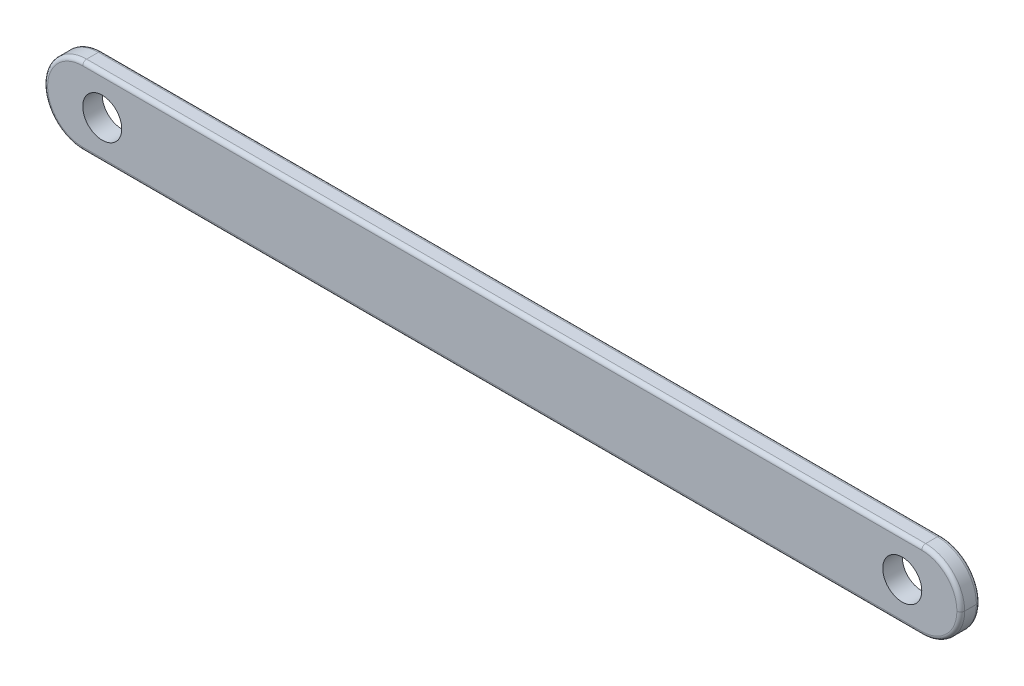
ISO-10303-21;
HEADER;
FILE_DESCRIPTION(('STEP AP214'),'2;1');
FILE_NAME('part.step','',(''),(''),'','','');
FILE_SCHEMA(('AUTOMOTIVE_DESIGN { 1 0 10303 214 1 1 1 1 }'));
ENDSEC;
DATA;
#1=APPLICATION_CONTEXT('core data for automotive mechanical design processes');
#2=APPLICATION_PROTOCOL_DEFINITION('international standard','automotive_design',2000,#1);
#3=PRODUCT_CONTEXT('',#1,'mechanical');
#4=PRODUCT('Part','Part','',(#3));
#5=PRODUCT_RELATED_PRODUCT_CATEGORY('part','',(#4));
#6=PRODUCT_DEFINITION_FORMATION('','',#4);
#7=PRODUCT_DEFINITION_CONTEXT('part definition',#1,'design');
#8=PRODUCT_DEFINITION('design','',#6,#7);
#9=PRODUCT_DEFINITION_SHAPE('','',#8);
#10=(LENGTH_UNIT() NAMED_UNIT(*) SI_UNIT(.MILLI.,.METRE.));
#11=(NAMED_UNIT(*) PLANE_ANGLE_UNIT() SI_UNIT($,.RADIAN.));
#12=(NAMED_UNIT(*) SI_UNIT($,.STERADIAN.) SOLID_ANGLE_UNIT());
#13=UNCERTAINTY_MEASURE_WITH_UNIT(LENGTH_MEASURE(1.E-05),#10,'distance_accuracy_value','');
#14=(GEOMETRIC_REPRESENTATION_CONTEXT(3) GLOBAL_UNCERTAINTY_ASSIGNED_CONTEXT((#13)) GLOBAL_UNIT_ASSIGNED_CONTEXT((#10,
#11,#12)) REPRESENTATION_CONTEXT('',''));
#15=CARTESIAN_POINT('',(0.,0.,0.));
#16=DIRECTION('',(0.,0.,1.));
#17=DIRECTION('',(1.,0.,0.));
#18=AXIS2_PLACEMENT_3D('',#15,#16,#17);
#19=CARTESIAN_POINT('',(0.,0.,5.));
#20=DIRECTION('',(0.,0.,1.));
#21=DIRECTION('',(1.,0.,0.));
#22=AXIS2_PLACEMENT_3D('',#19,#20,#21);
#23=PLANE('',#22);
#24=DIRECTION('',(1.,0.,0.));
#25=VECTOR('',#24,1.);
#26=CARTESIAN_POINT('',(-10.,0.999999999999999,5.));
#27=LINE('',#26,#25);
#28=CARTESIAN_POINT('',(-225.02,0.999999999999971,5.));
#29=VERTEX_POINT('',#28);
#30=CARTESIAN_POINT('',(-10.,0.999999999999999,5.));
#31=VERTEX_POINT('',#30);
#32=EDGE_CURVE('E63',#29,#31,#27,.T.);
#33=ORIENTED_EDGE('',*,*,#32,.T.);
#34=CARTESIAN_POINT('',(-10.,10.,5.));
#35=DIRECTION('',(0.,0.,1.));
#36=DIRECTION('',(1.,0.,0.));
#37=AXIS2_PLACEMENT_3D('',#34,#35,#36);
#38=CIRCLE('',#37,9.);
#39=CARTESIAN_POINT('',(-1.,10.,5.));
#40=VERTEX_POINT('',#39);
#41=EDGE_CURVE('E68',#31,#40,#38,.T.);
#42=ORIENTED_EDGE('',*,*,#41,.T.);
#43=CARTESIAN_POINT('',(-10.,10.,5.));
#44=DIRECTION('',(0.,0.,1.));
#45=DIRECTION('',(1.,0.,0.));
#46=AXIS2_PLACEMENT_3D('',#43,#44,#45);
#47=CIRCLE('',#46,9.);
#48=CARTESIAN_POINT('',(-10.,19.,5.));
#49=VERTEX_POINT('',#48);
#50=EDGE_CURVE('E226',#40,#49,#47,.T.);
#51=ORIENTED_EDGE('',*,*,#50,.T.);
#52=DIRECTION('',(-1.,0.,0.));
#53=VECTOR('',#52,1.);
#54=CARTESIAN_POINT('',(-225.02,19.,5.));
#55=LINE('',#54,#53);
#56=CARTESIAN_POINT('',(-225.02,19.,5.));
#57=VERTEX_POINT('',#56);
#58=EDGE_CURVE('E217',#49,#57,#55,.T.);
#59=ORIENTED_EDGE('',*,*,#58,.T.);
#60=CARTESIAN_POINT('',(-225.02,9.99999999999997,5.));
#61=DIRECTION('',(0.,0.,1.));
#62=DIRECTION('',(1.,0.,0.));
#63=AXIS2_PLACEMENT_3D('',#60,#61,#62);
#64=CIRCLE('',#63,9.);
#65=CARTESIAN_POINT('',(-234.02,9.99999999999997,5.));
#66=VERTEX_POINT('',#65);
#67=EDGE_CURVE('E220',#57,#66,#64,.T.);
#68=ORIENTED_EDGE('',*,*,#67,.T.);
#69=CARTESIAN_POINT('',(-225.02,9.99999999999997,5.));
#70=DIRECTION('',(0.,0.,1.));
#71=DIRECTION('',(1.,0.,0.));
#72=AXIS2_PLACEMENT_3D('',#69,#70,#71);
#73=CIRCLE('',#72,9.);
#74=EDGE_CURVE('E223',#66,#29,#73,.T.);
#75=ORIENTED_EDGE('',*,*,#74,.T.);
#76=EDGE_LOOP('',(#33,#42,#51,#59,#68,#75));
#77=FACE_BOUND('',#76,.T.);
#78=CARTESIAN_POINT('',(-220.02,10.,5.));
#79=DIRECTION('',(0.,0.,1.));
#80=DIRECTION('',(1.,0.,0.));
#81=AXIS2_PLACEMENT_3D('',#78,#79,#80);
#82=CIRCLE('',#81,4.99999999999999);
#83=CARTESIAN_POINT('',(-215.02,10.,5.));
#84=VERTEX_POINT('',#83);
#85=EDGE_CURVE('E310',#84,#84,#82,.T.);
#86=ORIENTED_EDGE('',*,*,#85,.F.);
#87=EDGE_LOOP('',(#86));
#88=FACE_BOUND('',#87,.T.);
#89=CARTESIAN_POINT('',(-15.,10.,5.));
#90=DIRECTION('',(0.,0.,1.));
#91=DIRECTION('',(1.,0.,0.));
#92=AXIS2_PLACEMENT_3D('',#89,#90,#91);
#93=CIRCLE('',#92,5.);
#94=CARTESIAN_POINT('',(-10.,10.,5.));
#95=VERTEX_POINT('',#94);
#96=EDGE_CURVE('E299',#95,#95,#93,.T.);
#97=ORIENTED_EDGE('',*,*,#96,.F.);
#98=EDGE_LOOP('',(#97));
#99=FACE_BOUND('',#98,.T.);
#100=ADVANCED_FACE('F45',(#77,#88,#99),#23,.T.);
#101=CARTESIAN_POINT('',(0.,0.,0.));
#102=DIRECTION('',(0.,0.,1.));
#103=DIRECTION('',(1.,0.,0.));
#104=AXIS2_PLACEMENT_3D('',#101,#102,#103);
#105=PLANE('',#104);
#106=DIRECTION('',(-1.,0.,0.));
#107=VECTOR('',#106,1.);
#108=CARTESIAN_POINT('',(0.,19.,0.));
#109=LINE('',#108,#107);
#110=CARTESIAN_POINT('',(-225.02,19.,0.));
#111=VERTEX_POINT('',#110);
#112=CARTESIAN_POINT('',(-10.,19.,0.));
#113=VERTEX_POINT('',#112);
#114=EDGE_CURVE('E141',#111,#113,#109,.F.);
#115=ORIENTED_EDGE('',*,*,#114,.T.);
#116=CARTESIAN_POINT('',(-10.,10.,0.));
#117=DIRECTION('',(0.,0.,1.));
#118=DIRECTION('',(1.,0.,0.));
#119=AXIS2_PLACEMENT_3D('',#116,#117,#118);
#120=CIRCLE('',#119,9.);
#121=CARTESIAN_POINT('',(-1.,10.,0.));
#122=VERTEX_POINT('',#121);
#123=EDGE_CURVE('E183',#113,#122,#120,.F.);
#124=ORIENTED_EDGE('',*,*,#123,.T.);
#125=CARTESIAN_POINT('',(-10.,10.,0.));
#126=DIRECTION('',(0.,0.,1.));
#127=DIRECTION('',(1.,0.,0.));
#128=AXIS2_PLACEMENT_3D('',#125,#126,#127);
#129=CIRCLE('',#128,9.);
#130=CARTESIAN_POINT('',(-10.,0.999999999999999,0.));
#131=VERTEX_POINT('',#130);
#132=EDGE_CURVE('E180',#122,#131,#129,.F.);
#133=ORIENTED_EDGE('',*,*,#132,.T.);
#134=DIRECTION('',(1.,0.,0.));
#135=VECTOR('',#134,1.);
#136=CARTESIAN_POINT('',(0.,1.,0.));
#137=LINE('',#136,#135);
#138=CARTESIAN_POINT('',(-225.02,0.999999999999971,0.));
#139=VERTEX_POINT('',#138);
#140=EDGE_CURVE('E177',#131,#139,#137,.F.);
#141=ORIENTED_EDGE('',*,*,#140,.T.);
#142=CARTESIAN_POINT('',(-225.02,9.99999999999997,0.));
#143=DIRECTION('',(0.,0.,1.));
#144=DIRECTION('',(1.,0.,0.));
#145=AXIS2_PLACEMENT_3D('',#142,#143,#144);
#146=CIRCLE('',#145,9.);
#147=CARTESIAN_POINT('',(-234.02,9.99999999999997,0.));
#148=VERTEX_POINT('',#147);
#149=EDGE_CURVE('E144',#139,#148,#146,.F.);
#150=ORIENTED_EDGE('',*,*,#149,.T.);
#151=CARTESIAN_POINT('',(-225.02,9.99999999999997,0.));
#152=DIRECTION('',(0.,0.,1.));
#153=DIRECTION('',(1.,0.,0.));
#154=AXIS2_PLACEMENT_3D('',#151,#152,#153);
#155=CIRCLE('',#154,9.);
#156=EDGE_CURVE('E135',#148,#111,#155,.F.);
#157=ORIENTED_EDGE('',*,*,#156,.T.);
#158=EDGE_LOOP('',(#115,#124,#133,#141,#150,#157));
#159=FACE_BOUND('',#158,.T.);
#160=CARTESIAN_POINT('',(-220.02,10.,0.));
#161=DIRECTION('',(0.,0.,1.));
#162=DIRECTION('',(1.,0.,0.));
#163=AXIS2_PLACEMENT_3D('',#160,#161,#162);
#164=CIRCLE('',#163,4.99999999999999);
#165=CARTESIAN_POINT('',(-215.02,10.,0.));
#166=VERTEX_POINT('',#165);
#167=EDGE_CURVE('E311',#166,#166,#164,.T.);
#168=ORIENTED_EDGE('',*,*,#167,.T.);
#169=EDGE_LOOP('',(#168));
#170=FACE_BOUND('',#169,.T.);
#171=CARTESIAN_POINT('',(-15.,10.,0.));
#172=DIRECTION('',(0.,0.,1.));
#173=DIRECTION('',(1.,0.,0.));
#174=AXIS2_PLACEMENT_3D('',#171,#172,#173);
#175=CIRCLE('',#174,5.);
#176=CARTESIAN_POINT('',(-10.,10.,0.));
#177=VERTEX_POINT('',#176);
#178=EDGE_CURVE('E294',#177,#177,#175,.T.);
#179=ORIENTED_EDGE('',*,*,#178,.T.);
#180=EDGE_LOOP('',(#179));
#181=FACE_BOUND('',#180,.T.);
#182=ADVANCED_FACE('F137',(#159,#170,#181),#105,.F.);
#183=CARTESIAN_POINT('',(0.,20.,5.));
#184=DIRECTION('',(0.,-1.,0.));
#185=DIRECTION('',(1.,0.,0.));
#186=AXIS2_PLACEMENT_3D('',#183,#184,#185);
#187=PLANE('',#186);
#188=DIRECTION('',(0.,0.,-1.));
#189=VECTOR('',#188,1.);
#190=CARTESIAN_POINT('',(-10.,20.,5.));
#191=LINE('',#190,#189);
#192=CARTESIAN_POINT('',(-10.,20.,4.));
#193=VERTEX_POINT('',#192);
#194=CARTESIAN_POINT('',(-10.,20.,1.));
#195=VERTEX_POINT('',#194);
#196=EDGE_CURVE('E165',#193,#195,#191,.T.);
#197=ORIENTED_EDGE('',*,*,#196,.T.);
#198=DIRECTION('',(-1.,0.,0.));
#199=VECTOR('',#198,1.);
#200=CARTESIAN_POINT('',(0.,20.,1.));
#201=LINE('',#200,#199);
#202=CARTESIAN_POINT('',(-225.02,20.,1.));
#203=VERTEX_POINT('',#202);
#204=EDGE_CURVE('E11',#195,#203,#201,.T.);
#205=ORIENTED_EDGE('',*,*,#204,.T.);
#206=DIRECTION('',(0.,0.,-1.));
#207=VECTOR('',#206,1.);
#208=CARTESIAN_POINT('',(-225.02,20.,5.));
#209=LINE('',#208,#207);
#210=CARTESIAN_POINT('',(-225.02,20.,4.));
#211=VERTEX_POINT('',#210);
#212=EDGE_CURVE('E169',#203,#211,#209,.F.);
#213=ORIENTED_EDGE('',*,*,#212,.T.);
#214=DIRECTION('',(-1.,0.,0.));
#215=VECTOR('',#214,1.);
#216=CARTESIAN_POINT('',(-10.,20.,4.));
#217=LINE('',#216,#215);
#218=EDGE_CURVE('E55',#211,#193,#217,.F.);
#219=ORIENTED_EDGE('',*,*,#218,.T.);
#220=EDGE_LOOP('',(#197,#205,#213,#219));
#221=FACE_BOUND('',#220,.T.);
#222=ADVANCED_FACE('F331',(#221),#187,.F.);
#223=CARTESIAN_POINT('',(0.,0.,5.));
#224=DIRECTION('',(0.,1.,0.));
#225=DIRECTION('',(-1.,0.,0.));
#226=AXIS2_PLACEMENT_3D('',#223,#224,#225);
#227=PLANE('',#226);
#228=DIRECTION('',(0.,0.,-1.));
#229=VECTOR('',#228,1.);
#230=CARTESIAN_POINT('',(-225.02,0.,5.));
#231=LINE('',#230,#229);
#232=CARTESIAN_POINT('',(-225.02,0.,4.));
#233=VERTEX_POINT('',#232);
#234=CARTESIAN_POINT('',(-225.02,0.,1.));
#235=VERTEX_POINT('',#234);
#236=EDGE_CURVE('E285',#233,#235,#231,.T.);
#237=ORIENTED_EDGE('',*,*,#236,.T.);
#238=DIRECTION('',(1.,0.,0.));
#239=VECTOR('',#238,1.);
#240=CARTESIAN_POINT('',(0.,0.,1.));
#241=LINE('',#240,#239);
#242=CARTESIAN_POINT('',(-10.,0.,1.));
#243=VERTEX_POINT('',#242);
#244=EDGE_CURVE('E203',#235,#243,#241,.T.);
#245=ORIENTED_EDGE('',*,*,#244,.T.);
#246=DIRECTION('',(0.,0.,-1.));
#247=VECTOR('',#246,1.);
#248=CARTESIAN_POINT('',(-10.,0.,5.));
#249=LINE('',#248,#247);
#250=CARTESIAN_POINT('',(-10.,0.,4.));
#251=VERTEX_POINT('',#250);
#252=EDGE_CURVE('E304',#243,#251,#249,.F.);
#253=ORIENTED_EDGE('',*,*,#252,.T.);
#254=DIRECTION('',(1.,0.,0.));
#255=VECTOR('',#254,1.);
#256=CARTESIAN_POINT('',(-225.02,0.,4.));
#257=LINE('',#256,#255);
#258=EDGE_CURVE('E200',#251,#233,#257,.F.);
#259=ORIENTED_EDGE('',*,*,#258,.T.);
#260=EDGE_LOOP('',(#237,#245,#253,#259));
#261=FACE_BOUND('',#260,.T.);
#262=ADVANCED_FACE('F338',(#261),#227,.F.);
#263=CARTESIAN_POINT('',(-220.02,10.,5.));
#264=DIRECTION('',(0.,0.,-1.));
#265=DIRECTION('',(-1.,0.,0.));
#266=AXIS2_PLACEMENT_3D('',#263,#264,#265);
#267=CYLINDRICAL_SURFACE('',#266,4.99999999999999);
#268=ORIENTED_EDGE('',*,*,#85,.T.);
#269=EDGE_LOOP('',(#268));
#270=FACE_BOUND('',#269,.T.);
#271=ORIENTED_EDGE('',*,*,#167,.F.);
#272=EDGE_LOOP('',(#271));
#273=FACE_BOUND('',#272,.T.);
#274=ADVANCED_FACE('F335',(#270,#273),#267,.F.);
#275=CARTESIAN_POINT('',(-15.,10.,5.));
#276=DIRECTION('',(0.,0.,-1.));
#277=DIRECTION('',(-1.,0.,0.));
#278=AXIS2_PLACEMENT_3D('',#275,#276,#277);
#279=CYLINDRICAL_SURFACE('',#278,5.);
#280=ORIENTED_EDGE('',*,*,#96,.T.);
#281=EDGE_LOOP('',(#280));
#282=FACE_BOUND('',#281,.T.);
#283=ORIENTED_EDGE('',*,*,#178,.F.);
#284=EDGE_LOOP('',(#283));
#285=FACE_BOUND('',#284,.T.);
#286=ADVANCED_FACE('F322',(#282,#285),#279,.F.);
#287=CARTESIAN_POINT('',(-10.,10.,5.));
#288=DIRECTION('',(0.,0.,-1.));
#289=DIRECTION('',(-1.,0.,0.));
#290=AXIS2_PLACEMENT_3D('',#287,#288,#289);
#291=CYLINDRICAL_SURFACE('',#290,10.);
#292=DIRECTION('',(0.,0.,-1.));
#293=VECTOR('',#292,1.);
#294=CARTESIAN_POINT('',(0.,10.,5.));
#295=LINE('',#294,#293);
#296=CARTESIAN_POINT('',(0.,10.,1.));
#297=VERTEX_POINT('',#296);
#298=CARTESIAN_POINT('',(0.,10.,4.));
#299=VERTEX_POINT('',#298);
#300=EDGE_CURVE('E291',#297,#299,#295,.F.);
#301=ORIENTED_EDGE('',*,*,#300,.F.);
#302=CARTESIAN_POINT('',(-10.,10.,1.));
#303=DIRECTION('',(0.,0.,1.));
#304=DIRECTION('',(1.,0.,0.));
#305=AXIS2_PLACEMENT_3D('',#302,#303,#304);
#306=CIRCLE('',#305,10.);
#307=EDGE_CURVE('E190',#297,#195,#306,.T.);
#308=ORIENTED_EDGE('',*,*,#307,.T.);
#309=ORIENTED_EDGE('',*,*,#196,.F.);
#310=CARTESIAN_POINT('',(-10.,10.,4.));
#311=DIRECTION('',(0.,0.,1.));
#312=DIRECTION('',(1.,0.,0.));
#313=AXIS2_PLACEMENT_3D('',#310,#311,#312);
#314=CIRCLE('',#313,10.);
#315=EDGE_CURVE('E186',#193,#299,#314,.F.);
#316=ORIENTED_EDGE('',*,*,#315,.T.);
#317=EDGE_LOOP('',(#301,#308,#309,#316));
#318=FACE_BOUND('',#317,.T.);
#319=ADVANCED_FACE('F348',(#318),#291,.T.);
#320=CARTESIAN_POINT('',(-10.,10.,5.));
#321=DIRECTION('',(0.,0.,-1.));
#322=DIRECTION('',(-1.,0.,0.));
#323=AXIS2_PLACEMENT_3D('',#320,#321,#322);
#324=CYLINDRICAL_SURFACE('',#323,10.);
#325=ORIENTED_EDGE('',*,*,#252,.F.);
#326=CARTESIAN_POINT('',(-10.,10.,1.));
#327=DIRECTION('',(0.,0.,1.));
#328=DIRECTION('',(1.,0.,0.));
#329=AXIS2_PLACEMENT_3D('',#326,#327,#328);
#330=CIRCLE('',#329,10.);
#331=EDGE_CURVE('E197',#243,#297,#330,.T.);
#332=ORIENTED_EDGE('',*,*,#331,.T.);
#333=ORIENTED_EDGE('',*,*,#300,.T.);
#334=CARTESIAN_POINT('',(-10.,10.,4.));
#335=DIRECTION('',(0.,0.,1.));
#336=DIRECTION('',(1.,0.,0.));
#337=AXIS2_PLACEMENT_3D('',#334,#335,#336);
#338=CIRCLE('',#337,10.);
#339=EDGE_CURVE('E194',#299,#251,#338,.F.);
#340=ORIENTED_EDGE('',*,*,#339,.T.);
#341=EDGE_LOOP('',(#325,#332,#333,#340));
#342=FACE_BOUND('',#341,.T.);
#343=ADVANCED_FACE('F345',(#342),#324,.T.);
#344=CARTESIAN_POINT('',(-225.02,9.99999999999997,5.));
#345=DIRECTION('',(0.,0.,-1.));
#346=DIRECTION('',(-1.,0.,0.));
#347=AXIS2_PLACEMENT_3D('',#344,#345,#346);
#348=CYLINDRICAL_SURFACE('',#347,10.);
#349=ORIENTED_EDGE('',*,*,#212,.F.);
#350=CARTESIAN_POINT('',(-225.02,9.99999999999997,1.));
#351=DIRECTION('',(0.,0.,1.));
#352=DIRECTION('',(1.,0.,0.));
#353=AXIS2_PLACEMENT_3D('',#350,#351,#352);
#354=CIRCLE('',#353,10.);
#355=CARTESIAN_POINT('',(-235.02,9.99999999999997,1.));
#356=VERTEX_POINT('',#355);
#357=EDGE_CURVE('E154',#203,#356,#354,.T.);
#358=ORIENTED_EDGE('',*,*,#357,.T.);
#359=DIRECTION('',(0.,0.,-1.));
#360=VECTOR('',#359,1.);
#361=CARTESIAN_POINT('',(-235.02,9.99999999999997,5.));
#362=LINE('',#361,#360);
#363=CARTESIAN_POINT('',(-235.02,9.99999999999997,4.));
#364=VERTEX_POINT('',#363);
#365=EDGE_CURVE('E172',#364,#356,#362,.T.);
#366=ORIENTED_EDGE('',*,*,#365,.F.);
#367=CARTESIAN_POINT('',(-225.02,9.99999999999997,4.));
#368=DIRECTION('',(0.,0.,1.));
#369=DIRECTION('',(1.,0.,0.));
#370=AXIS2_PLACEMENT_3D('',#367,#368,#369);
#371=CIRCLE('',#370,10.);
#372=EDGE_CURVE('E212',#364,#211,#371,.F.);
#373=ORIENTED_EDGE('',*,*,#372,.T.);
#374=EDGE_LOOP('',(#349,#358,#366,#373));
#375=FACE_BOUND('',#374,.T.);
#376=ADVANCED_FACE('F288',(#375),#348,.T.);
#377=CARTESIAN_POINT('',(-225.02,9.99999999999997,5.));
#378=DIRECTION('',(0.,0.,-1.));
#379=DIRECTION('',(-1.,0.,0.));
#380=AXIS2_PLACEMENT_3D('',#377,#378,#379);
#381=CYLINDRICAL_SURFACE('',#380,10.);
#382=ORIENTED_EDGE('',*,*,#365,.T.);
#383=CARTESIAN_POINT('',(-225.02,9.99999999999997,1.));
#384=DIRECTION('',(0.,0.,1.));
#385=DIRECTION('',(1.,0.,0.));
#386=AXIS2_PLACEMENT_3D('',#383,#384,#385);
#387=CIRCLE('',#386,10.);
#388=EDGE_CURVE('E209',#356,#235,#387,.T.);
#389=ORIENTED_EDGE('',*,*,#388,.T.);
#390=ORIENTED_EDGE('',*,*,#236,.F.);
#391=CARTESIAN_POINT('',(-225.02,9.99999999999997,4.));
#392=DIRECTION('',(0.,0.,1.));
#393=DIRECTION('',(1.,0.,0.));
#394=AXIS2_PLACEMENT_3D('',#391,#392,#393);
#395=CIRCLE('',#394,10.);
#396=EDGE_CURVE('E206',#233,#364,#395,.F.);
#397=ORIENTED_EDGE('',*,*,#396,.T.);
#398=EDGE_LOOP('',(#382,#389,#390,#397));
#399=FACE_BOUND('',#398,.T.);
#400=ADVANCED_FACE('F282',(#399),#381,.T.);
#401=CARTESIAN_POINT('',(-225.02,9.99999999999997,1.));
#402=DIRECTION('',(0.,0.,1.));
#403=DIRECTION('',(1.,0.,0.));
#404=AXIS2_PLACEMENT_3D('',#401,#402,#403);
#405=TOROIDAL_SURFACE('',#404,9.,1.);
#406=CARTESIAN_POINT('',(-225.02,0.999999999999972,1.));
#407=DIRECTION('',(1.,0.,0.));
#408=DIRECTION('',(0.,0.,-1.));
#409=AXIS2_PLACEMENT_3D('',#406,#407,#408);
#410=CIRCLE('',#409,1.);
#411=EDGE_CURVE('E158',#235,#139,#410,.T.);
#412=ORIENTED_EDGE('',*,*,#411,.F.);
#413=ORIENTED_EDGE('',*,*,#388,.F.);
#414=CARTESIAN_POINT('',(-234.02,9.99999999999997,1.));
#415=DIRECTION('',(0.,1.,0.));
#416=DIRECTION('',(0.,0.,1.));
#417=AXIS2_PLACEMENT_3D('',#414,#415,#416);
#418=CIRCLE('',#417,1.);
#419=EDGE_CURVE('E246',#148,#356,#418,.T.);
#420=ORIENTED_EDGE('',*,*,#419,.F.);
#421=ORIENTED_EDGE('',*,*,#149,.F.);
#422=EDGE_LOOP('',(#412,#413,#420,#421));
#423=FACE_BOUND('',#422,.T.);
#424=ADVANCED_FACE('F354',(#423),#405,.T.);
#425=CARTESIAN_POINT('',(-225.02,9.99999999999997,1.));
#426=DIRECTION('',(0.,0.,1.));
#427=DIRECTION('',(1.,0.,0.));
#428=AXIS2_PLACEMENT_3D('',#425,#426,#427);
#429=TOROIDAL_SURFACE('',#428,9.,1.);
#430=ORIENTED_EDGE('',*,*,#419,.T.);
#431=ORIENTED_EDGE('',*,*,#357,.F.);
#432=CARTESIAN_POINT('',(-225.02,19.,1.));
#433=DIRECTION('',(1.,0.,0.));
#434=DIRECTION('',(0.,0.,-1.));
#435=AXIS2_PLACEMENT_3D('',#432,#433,#434);
#436=CIRCLE('',#435,1.);
#437=EDGE_CURVE('E152',#111,#203,#436,.T.);
#438=ORIENTED_EDGE('',*,*,#437,.F.);
#439=ORIENTED_EDGE('',*,*,#156,.F.);
#440=EDGE_LOOP('',(#430,#431,#438,#439));
#441=FACE_BOUND('',#440,.T.);
#442=ADVANCED_FACE('F153',(#441),#429,.T.);
#443=CARTESIAN_POINT('',(0.,1.,1.));
#444=DIRECTION('',(1.,0.,0.));
#445=DIRECTION('',(0.,1.,0.));
#446=AXIS2_PLACEMENT_3D('',#443,#444,#445);
#447=CYLINDRICAL_SURFACE('',#446,1.);
#448=ORIENTED_EDGE('',*,*,#411,.T.);
#449=ORIENTED_EDGE('',*,*,#140,.F.);
#450=CARTESIAN_POINT('',(-10.,0.999999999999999,1.));
#451=DIRECTION('',(1.,0.,0.));
#452=DIRECTION('',(0.,0.,-1.));
#453=AXIS2_PLACEMENT_3D('',#450,#451,#452);
#454=CIRCLE('',#453,1.);
#455=EDGE_CURVE('E159',#243,#131,#454,.T.);
#456=ORIENTED_EDGE('',*,*,#455,.F.);
#457=ORIENTED_EDGE('',*,*,#244,.F.);
#458=EDGE_LOOP('',(#448,#449,#456,#457));
#459=FACE_BOUND('',#458,.T.);
#460=ADVANCED_FACE('F367',(#459),#447,.T.);
#461=CARTESIAN_POINT('',(0.,19.,1.));
#462=DIRECTION('',(-1.,0.,0.));
#463=DIRECTION('',(0.,-1.,0.));
#464=AXIS2_PLACEMENT_3D('',#461,#462,#463);
#465=CYLINDRICAL_SURFACE('',#464,1.);
#466=ORIENTED_EDGE('',*,*,#437,.T.);
#467=ORIENTED_EDGE('',*,*,#204,.F.);
#468=CARTESIAN_POINT('',(-10.,19.,1.));
#469=DIRECTION('',(1.,0.,0.));
#470=DIRECTION('',(0.,0.,-1.));
#471=AXIS2_PLACEMENT_3D('',#468,#469,#470);
#472=CIRCLE('',#471,1.);
#473=EDGE_CURVE('E162',#113,#195,#472,.T.);
#474=ORIENTED_EDGE('',*,*,#473,.F.);
#475=ORIENTED_EDGE('',*,*,#114,.F.);
#476=EDGE_LOOP('',(#466,#467,#474,#475));
#477=FACE_BOUND('',#476,.T.);
#478=ADVANCED_FACE('F161',(#477),#465,.T.);
#479=CARTESIAN_POINT('',(-10.,10.,1.));
#480=DIRECTION('',(0.,0.,1.));
#481=DIRECTION('',(1.,0.,0.));
#482=AXIS2_PLACEMENT_3D('',#479,#480,#481);
#483=TOROIDAL_SURFACE('',#482,9.,1.);
#484=ORIENTED_EDGE('',*,*,#455,.T.);
#485=ORIENTED_EDGE('',*,*,#132,.F.);
#486=CARTESIAN_POINT('',(-1.,10.,1.));
#487=DIRECTION('',(0.,1.,0.));
#488=DIRECTION('',(0.,0.,1.));
#489=AXIS2_PLACEMENT_3D('',#486,#487,#488);
#490=CIRCLE('',#489,1.);
#491=EDGE_CURVE('E235',#297,#122,#490,.T.);
#492=ORIENTED_EDGE('',*,*,#491,.F.);
#493=ORIENTED_EDGE('',*,*,#331,.F.);
#494=EDGE_LOOP('',(#484,#485,#492,#493));
#495=FACE_BOUND('',#494,.T.);
#496=ADVANCED_FACE('F360',(#495),#483,.T.);
#497=CARTESIAN_POINT('',(-10.,10.,1.));
#498=DIRECTION('',(0.,0.,1.));
#499=DIRECTION('',(1.,0.,0.));
#500=AXIS2_PLACEMENT_3D('',#497,#498,#499);
#501=TOROIDAL_SURFACE('',#500,9.,1.);
#502=ORIENTED_EDGE('',*,*,#473,.T.);
#503=ORIENTED_EDGE('',*,*,#307,.F.);
#504=ORIENTED_EDGE('',*,*,#491,.T.);
#505=ORIENTED_EDGE('',*,*,#123,.F.);
#506=EDGE_LOOP('',(#502,#503,#504,#505));
#507=FACE_BOUND('',#506,.T.);
#508=ADVANCED_FACE('F357',(#507),#501,.T.);
#509=CARTESIAN_POINT('',(-225.02,9.99999999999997,4.));
#510=DIRECTION('',(0.,0.,1.));
#511=DIRECTION('',(1.,0.,0.));
#512=AXIS2_PLACEMENT_3D('',#509,#510,#511);
#513=TOROIDAL_SURFACE('',#512,9.,1.);
#514=CARTESIAN_POINT('',(-234.02,9.99999999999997,4.));
#515=DIRECTION('',(0.,1.,0.));
#516=DIRECTION('',(0.,0.,1.));
#517=AXIS2_PLACEMENT_3D('',#514,#515,#516);
#518=CIRCLE('',#517,1.);
#519=EDGE_CURVE('E262',#364,#66,#518,.T.);
#520=ORIENTED_EDGE('',*,*,#519,.F.);
#521=ORIENTED_EDGE('',*,*,#396,.F.);
#522=CARTESIAN_POINT('',(-225.02,0.999999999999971,4.));
#523=DIRECTION('',(1.,0.,0.));
#524=DIRECTION('',(0.,0.,-1.));
#525=AXIS2_PLACEMENT_3D('',#522,#523,#524);
#526=CIRCLE('',#525,1.);
#527=EDGE_CURVE('E49',#29,#233,#526,.T.);
#528=ORIENTED_EDGE('',*,*,#527,.F.);
#529=ORIENTED_EDGE('',*,*,#74,.F.);
#530=EDGE_LOOP('',(#520,#521,#528,#529));
#531=FACE_BOUND('',#530,.T.);
#532=ADVANCED_FACE('F47',(#531),#513,.T.);
#533=CARTESIAN_POINT('',(0.,1.,4.));
#534=DIRECTION('',(-1.,0.,0.));
#535=DIRECTION('',(0.,-1.,0.));
#536=AXIS2_PLACEMENT_3D('',#533,#534,#535);
#537=CYLINDRICAL_SURFACE('',#536,1.);
#538=ORIENTED_EDGE('',*,*,#527,.T.);
#539=ORIENTED_EDGE('',*,*,#258,.F.);
#540=CARTESIAN_POINT('',(-10.,0.999999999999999,4.));
#541=DIRECTION('',(1.,0.,0.));
#542=DIRECTION('',(0.,0.,-1.));
#543=AXIS2_PLACEMENT_3D('',#540,#541,#542);
#544=CIRCLE('',#543,1.);
#545=EDGE_CURVE('E259',#31,#251,#544,.T.);
#546=ORIENTED_EDGE('',*,*,#545,.F.);
#547=ORIENTED_EDGE('',*,*,#32,.F.);
#548=EDGE_LOOP('',(#538,#539,#546,#547));
#549=FACE_BOUND('',#548,.T.);
#550=ADVANCED_FACE('F274',(#549),#537,.T.);
#551=CARTESIAN_POINT('',(-225.02,9.99999999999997,4.));
#552=DIRECTION('',(0.,0.,1.));
#553=DIRECTION('',(1.,0.,0.));
#554=AXIS2_PLACEMENT_3D('',#551,#552,#553);
#555=TOROIDAL_SURFACE('',#554,9.,1.);
#556=ORIENTED_EDGE('',*,*,#519,.T.);
#557=ORIENTED_EDGE('',*,*,#67,.F.);
#558=CARTESIAN_POINT('',(-225.02,19.,4.));
#559=DIRECTION('',(1.,0.,0.));
#560=DIRECTION('',(0.,0.,-1.));
#561=AXIS2_PLACEMENT_3D('',#558,#559,#560);
#562=CIRCLE('',#561,1.);
#563=EDGE_CURVE('E255',#211,#57,#562,.T.);
#564=ORIENTED_EDGE('',*,*,#563,.F.);
#565=ORIENTED_EDGE('',*,*,#372,.F.);
#566=EDGE_LOOP('',(#556,#557,#564,#565));
#567=FACE_BOUND('',#566,.T.);
#568=ADVANCED_FACE('F387',(#567),#555,.T.);
#569=CARTESIAN_POINT('',(-10.,10.,4.));
#570=DIRECTION('',(0.,0.,1.));
#571=DIRECTION('',(1.,0.,0.));
#572=AXIS2_PLACEMENT_3D('',#569,#570,#571);
#573=TOROIDAL_SURFACE('',#572,9.,1.);
#574=ORIENTED_EDGE('',*,*,#545,.T.);
#575=ORIENTED_EDGE('',*,*,#339,.F.);
#576=CARTESIAN_POINT('',(-1.,10.,4.));
#577=DIRECTION('',(0.,1.,0.));
#578=DIRECTION('',(0.,0.,1.));
#579=AXIS2_PLACEMENT_3D('',#576,#577,#578);
#580=CIRCLE('',#579,1.);
#581=EDGE_CURVE('E252',#40,#299,#580,.T.);
#582=ORIENTED_EDGE('',*,*,#581,.F.);
#583=ORIENTED_EDGE('',*,*,#41,.F.);
#584=EDGE_LOOP('',(#574,#575,#582,#583));
#585=FACE_BOUND('',#584,.T.);
#586=ADVANCED_FACE('F383',(#585),#573,.T.);
#587=CARTESIAN_POINT('',(0.,19.,4.));
#588=DIRECTION('',(1.,0.,0.));
#589=DIRECTION('',(0.,1.,0.));
#590=AXIS2_PLACEMENT_3D('',#587,#588,#589);
#591=CYLINDRICAL_SURFACE('',#590,1.);
#592=ORIENTED_EDGE('',*,*,#563,.T.);
#593=ORIENTED_EDGE('',*,*,#58,.F.);
#594=CARTESIAN_POINT('',(-10.,19.,4.));
#595=DIRECTION('',(1.,0.,0.));
#596=DIRECTION('',(0.,0.,-1.));
#597=AXIS2_PLACEMENT_3D('',#594,#595,#596);
#598=CIRCLE('',#597,1.);
#599=EDGE_CURVE('E249',#193,#49,#598,.T.);
#600=ORIENTED_EDGE('',*,*,#599,.F.);
#601=ORIENTED_EDGE('',*,*,#218,.F.);
#602=EDGE_LOOP('',(#592,#593,#600,#601));
#603=FACE_BOUND('',#602,.T.);
#604=ADVANCED_FACE('F379',(#603),#591,.T.);
#605=CARTESIAN_POINT('',(-10.,10.,4.));
#606=DIRECTION('',(0.,0.,1.));
#607=DIRECTION('',(1.,0.,0.));
#608=AXIS2_PLACEMENT_3D('',#605,#606,#607);
#609=TOROIDAL_SURFACE('',#608,9.,1.);
#610=ORIENTED_EDGE('',*,*,#581,.T.);
#611=ORIENTED_EDGE('',*,*,#315,.F.);
#612=ORIENTED_EDGE('',*,*,#599,.T.);
#613=ORIENTED_EDGE('',*,*,#50,.F.);
#614=EDGE_LOOP('',(#610,#611,#612,#613));
#615=FACE_BOUND('',#614,.T.);
#616=ADVANCED_FACE('F376',(#615),#609,.T.);
#617=CLOSED_SHELL('',(#100,#182,#222,#262,#274,#286,#319,#343,#376,#400,#424,#442,#460,#478,
#496,#508,#532,#550,#568,#586,#604,#616));
#618=MANIFOLD_SOLID_BREP('B2',#617);
#619=ADVANCED_BREP_SHAPE_REPRESENTATION('',(#18,#618),#14);
#620=SHAPE_DEFINITION_REPRESENTATION(#9,#619);
ENDSEC;
END-ISO-10303-21;
